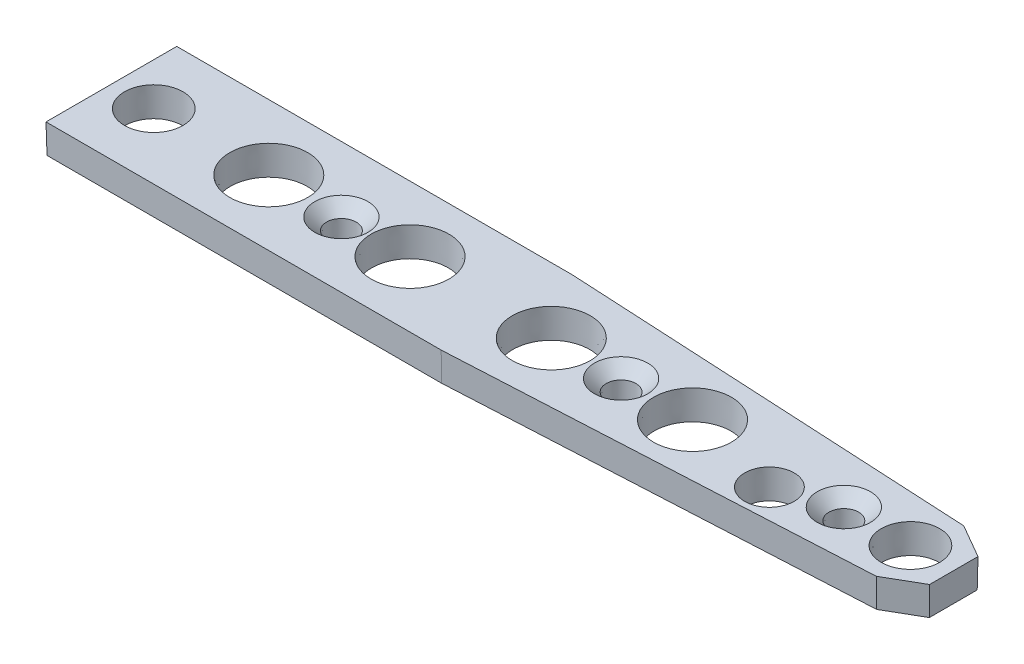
ISO-10303-21;
HEADER;
FILE_DESCRIPTION(('STEP AP214'),'2;1');
FILE_NAME('part.step','',(''),(''),'','','');
FILE_SCHEMA(('AUTOMOTIVE_DESIGN { 1 0 10303 214 1 1 1 1 }'));
ENDSEC;
DATA;
#1=APPLICATION_CONTEXT('core data for automotive mechanical design processes');
#2=APPLICATION_PROTOCOL_DEFINITION('international standard','automotive_design',2000,#1);
#3=PRODUCT_CONTEXT('',#1,'mechanical');
#4=PRODUCT('Part','Part','',(#3));
#5=PRODUCT_RELATED_PRODUCT_CATEGORY('part','',(#4));
#6=PRODUCT_DEFINITION_FORMATION('','',#4);
#7=PRODUCT_DEFINITION_CONTEXT('part definition',#1,'design');
#8=PRODUCT_DEFINITION('design','',#6,#7);
#9=PRODUCT_DEFINITION_SHAPE('','',#8);
#10=(LENGTH_UNIT() NAMED_UNIT(*) SI_UNIT(.MILLI.,.METRE.));
#11=(NAMED_UNIT(*) PLANE_ANGLE_UNIT() SI_UNIT($,.RADIAN.));
#12=(NAMED_UNIT(*) SI_UNIT($,.STERADIAN.) SOLID_ANGLE_UNIT());
#13=UNCERTAINTY_MEASURE_WITH_UNIT(LENGTH_MEASURE(1.E-05),#10,'distance_accuracy_value','');
#14=(GEOMETRIC_REPRESENTATION_CONTEXT(3) GLOBAL_UNCERTAINTY_ASSIGNED_CONTEXT((#13)) GLOBAL_UNIT_ASSIGNED_CONTEXT((#10,
#11,#12)) REPRESENTATION_CONTEXT('',''));
#15=CARTESIAN_POINT('',(0.,0.,0.));
#16=DIRECTION('',(0.,0.,1.));
#17=DIRECTION('',(1.,0.,0.));
#18=AXIS2_PLACEMENT_3D('',#15,#16,#17);
#19=CARTESIAN_POINT('',(66.7909755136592,0.,3.61024403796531));
#20=DIRECTION('',(0.0523279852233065,-0.0174524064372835,0.99847743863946));
#21=DIRECTION('',(0.998629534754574,0.,-0.0523359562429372));
#22=AXIS2_PLACEMENT_3D('',#19,#20,#21);
#23=PLANE('',#22);
#24=DIRECTION('',(-0.998629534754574,0.,0.0523359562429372));
#25=VECTOR('',#24,1.);
#26=CARTESIAN_POINT('',(66.7887830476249,-2.4,3.56840929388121));
#27=LINE('',#26,#25);
#28=CARTESIAN_POINT('',(66.7787394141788,-2.4,3.56893565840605));
#29=VERTEX_POINT('',#28);
#30=CARTESIAN_POINT('',(32.6393003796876,-2.4,5.35810784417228));
#31=VERTEX_POINT('',#30);
#32=EDGE_CURVE('E44',#29,#31,#27,.T.);
#33=ORIENTED_EDGE('',*,*,#32,.F.);
#34=DIRECTION('',(0.00509755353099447,0.999838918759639,0.0172090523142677));
#35=VECTOR('',#34,1.);
#36=CARTESIAN_POINT('',(66.7909755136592,0.,3.61024403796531));
#37=LINE('',#36,#35);
#38=CARTESIAN_POINT('',(66.7909755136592,0.,3.61024403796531));
#39=VERTEX_POINT('',#38);
#40=EDGE_CURVE('E101',#29,#39,#37,.T.);
#41=ORIENTED_EDGE('',*,*,#40,.T.);
#42=DIRECTION('',(0.998629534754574,0.,-0.0523359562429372));
#43=VECTOR('',#42,1.);
#44=CARTESIAN_POINT('',(66.7909755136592,0.,3.61024403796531));
#45=LINE('',#44,#43);
#46=CARTESIAN_POINT('',(32.6403973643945,0.,5.4));
#47=VERTEX_POINT('',#46);
#48=EDGE_CURVE('E105',#47,#39,#45,.T.);
#49=ORIENTED_EDGE('',*,*,#48,.F.);
#50=DIRECTION('',(0.000457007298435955,0.999847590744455,0.0174524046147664));
#51=VECTOR('',#50,1.);
#52=CARTESIAN_POINT('',(32.6403973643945,0.,5.4));
#53=LINE('',#52,#51);
#54=EDGE_CURVE('E187',#31,#47,#53,.T.);
#55=ORIENTED_EDGE('',*,*,#54,.F.);
#56=EDGE_LOOP('',(#33,#41,#49,#55));
#57=FACE_BOUND('',#56,.T.);
#58=ADVANCED_FACE('F34',(#57),#23,.T.);
#59=CARTESIAN_POINT('',(32.6403973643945,0.,5.4));
#60=DIRECTION('',(0.,-0.0174524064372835,0.999847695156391));
#61=DIRECTION('',(0.,-0.999847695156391,-0.0174524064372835));
#62=AXIS2_PLACEMENT_3D('',#59,#60,#61);
#63=PLANE('',#62);
#64=DIRECTION('',(-1.,0.,0.));
#65=VECTOR('',#64,1.);
#66=CARTESIAN_POINT('',(32.6403973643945,-2.4,5.35810784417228));
#67=LINE('',#66,#65);
#68=CARTESIAN_POINT('',(0.0418921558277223,-2.4,5.35810784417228));
#69=VERTEX_POINT('',#68);
#70=EDGE_CURVE('E38',#31,#69,#67,.T.);
#71=ORIENTED_EDGE('',*,*,#70,.F.);
#72=ORIENTED_EDGE('',*,*,#54,.T.);
#73=DIRECTION('',(1.,0.,0.));
#74=VECTOR('',#73,1.);
#75=CARTESIAN_POINT('',(32.6403973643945,0.,5.4));
#76=LINE('',#75,#74);
#77=CARTESIAN_POINT('',(0.,0.,5.4));
#78=VERTEX_POINT('',#77);
#79=EDGE_CURVE('E110',#78,#47,#76,.T.);
#80=ORIENTED_EDGE('',*,*,#79,.F.);
#81=DIRECTION('',(-0.0174497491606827,0.999695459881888,0.0174497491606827));
#82=VECTOR('',#81,1.);
#83=CARTESIAN_POINT('',(0.00328853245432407,-0.188399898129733,5.39671146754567));
#84=LINE('',#83,#82);
#85=EDGE_CURVE('E185',#69,#78,#84,.T.);
#86=ORIENTED_EDGE('',*,*,#85,.F.);
#87=EDGE_LOOP('',(#71,#72,#80,#86));
#88=FACE_BOUND('',#87,.T.);
#89=ADVANCED_FACE('F36',(#88),#63,.T.);
#90=CARTESIAN_POINT('',(0.,0.,-5.4));
#91=DIRECTION('',(-0.999847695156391,-0.0174524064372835,0.));
#92=DIRECTION('',(0.0174524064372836,-0.999847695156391,0.));
#93=AXIS2_PLACEMENT_3D('',#90,#91,#92);
#94=PLANE('',#93);
#95=DIRECTION('',(0.,0.,-1.));
#96=VECTOR('',#95,1.);
#97=CARTESIAN_POINT('',(0.0418921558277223,-2.4,-5.4));
#98=LINE('',#97,#96);
#99=CARTESIAN_POINT('',(0.0418921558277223,-2.4,-5.35810784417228));
#100=VERTEX_POINT('',#99);
#101=EDGE_CURVE('E73',#69,#100,#98,.T.);
#102=ORIENTED_EDGE('',*,*,#101,.F.);
#103=ORIENTED_EDGE('',*,*,#85,.T.);
#104=DIRECTION('',(0.,0.,1.));
#105=VECTOR('',#104,1.);
#106=CARTESIAN_POINT('',(0.,0.,-5.4));
#107=LINE('',#106,#105);
#108=CARTESIAN_POINT('',(0.,0.,-5.4));
#109=VERTEX_POINT('',#108);
#110=EDGE_CURVE('E142',#109,#78,#107,.T.);
#111=ORIENTED_EDGE('',*,*,#110,.F.);
#112=DIRECTION('',(-0.0174497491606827,0.999695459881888,-0.0174497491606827));
#113=VECTOR('',#112,1.);
#114=CARTESIAN_POINT('',(0.,0.,-5.4));
#115=LINE('',#114,#113);
#116=EDGE_CURVE('E188',#100,#109,#115,.T.);
#117=ORIENTED_EDGE('',*,*,#116,.F.);
#118=EDGE_LOOP('',(#102,#103,#111,#117));
#119=FACE_BOUND('',#118,.T.);
#120=ADVANCED_FACE('F226',(#119),#94,.T.);
#121=CARTESIAN_POINT('',(0.,0.,-5.4));
#122=DIRECTION('',(0.,-0.0174524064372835,-0.999847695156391));
#123=DIRECTION('',(0.,0.999847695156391,-0.0174524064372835));
#124=AXIS2_PLACEMENT_3D('',#121,#122,#123);
#125=PLANE('',#124);
#126=DIRECTION('',(1.,0.,0.));
#127=VECTOR('',#126,1.);
#128=CARTESIAN_POINT('',(0.,-2.4,-5.35810784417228));
#129=LINE('',#128,#127);
#130=CARTESIAN_POINT('',(32.6393003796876,-2.4,-5.35810784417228));
#131=VERTEX_POINT('',#130);
#132=EDGE_CURVE('E200',#100,#131,#129,.T.);
#133=ORIENTED_EDGE('',*,*,#132,.F.);
#134=ORIENTED_EDGE('',*,*,#116,.T.);
#135=DIRECTION('',(-1.,0.,0.));
#136=VECTOR('',#135,1.);
#137=CARTESIAN_POINT('',(0.,0.,-5.4));
#138=LINE('',#137,#136);
#139=CARTESIAN_POINT('',(32.6403973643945,0.,-5.4));
#140=VERTEX_POINT('',#139);
#141=EDGE_CURVE('E139',#140,#109,#138,.T.);
#142=ORIENTED_EDGE('',*,*,#141,.F.);
#143=DIRECTION('',(0.000457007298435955,0.999847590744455,-0.0174524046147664));
#144=VECTOR('',#143,1.);
#145=CARTESIAN_POINT('',(32.6403973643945,0.,-5.4));
#146=LINE('',#145,#144);
#147=EDGE_CURVE('E190',#131,#140,#146,.T.);
#148=ORIENTED_EDGE('',*,*,#147,.F.);
#149=EDGE_LOOP('',(#133,#134,#142,#148));
#150=FACE_BOUND('',#149,.T.);
#151=ADVANCED_FACE('F220',(#150),#125,.T.);
#152=CARTESIAN_POINT('',(32.6403973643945,0.,-5.4));
#153=DIRECTION('',(0.0523279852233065,-0.0174524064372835,-0.99847743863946));
#154=DIRECTION('',(-0.998629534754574,0.,-0.0523359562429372));
#155=AXIS2_PLACEMENT_3D('',#152,#153,#154);
#156=PLANE('',#155);
#157=DIRECTION('',(0.998629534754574,0.,0.0523359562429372));
#158=VECTOR('',#157,1.);
#159=CARTESIAN_POINT('',(32.6382048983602,-2.4,-5.3581652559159));
#160=LINE('',#159,#158);
#161=CARTESIAN_POINT('',(66.7787394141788,-2.4,-3.56893565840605));
#162=VERTEX_POINT('',#161);
#163=EDGE_CURVE('E202',#131,#162,#160,.T.);
#164=ORIENTED_EDGE('',*,*,#163,.F.);
#165=ORIENTED_EDGE('',*,*,#147,.T.);
#166=DIRECTION('',(-0.998629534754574,0.,-0.0523359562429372));
#167=VECTOR('',#166,1.);
#168=CARTESIAN_POINT('',(32.6403973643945,0.,-5.4));
#169=LINE('',#168,#167);
#170=CARTESIAN_POINT('',(66.7909755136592,0.,-3.61024403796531));
#171=VERTEX_POINT('',#170);
#172=EDGE_CURVE('E136',#171,#140,#169,.T.);
#173=ORIENTED_EDGE('',*,*,#172,.F.);
#174=DIRECTION('',(0.00509755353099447,0.999838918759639,-0.0172090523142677));
#175=VECTOR('',#174,1.);
#176=CARTESIAN_POINT('',(66.7909067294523,-0.0134913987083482,-3.61001182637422));
#177=LINE('',#176,#175);
#178=EDGE_CURVE('E192',#162,#171,#177,.T.);
#179=ORIENTED_EDGE('',*,*,#178,.F.);
#180=EDGE_LOOP('',(#164,#165,#173,#179));
#181=FACE_BOUND('',#180,.T.);
#182=ADVANCED_FACE('F216',(#181),#156,.T.);
#183=CARTESIAN_POINT('',(69.58,0.,-2.));
#184=DIRECTION('',(0.4999238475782,-0.0174524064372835,-0.865893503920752));
#185=DIRECTION('',(-0.866025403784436,0.,-0.500000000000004));
#186=AXIS2_PLACEMENT_3D('',#183,#184,#185);
#187=PLANE('',#186);
#188=DIRECTION('',(0.866025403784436,0.,0.500000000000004));
#189=VECTOR('',#188,1.);
#190=CARTESIAN_POINT('',(69.5590539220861,-2.4,-1.9637203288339));
#191=LINE('',#190,#189);
#192=CARTESIAN_POINT('',(69.5381078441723,-2.4,-1.97581355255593));
#193=VERTEX_POINT('',#192);
#194=EDGE_CURVE('E53',#162,#193,#191,.T.);
#195=ORIENTED_EDGE('',*,*,#194,.F.);
#196=ORIENTED_EDGE('',*,*,#178,.T.);
#197=DIRECTION('',(-0.866025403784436,0.,-0.500000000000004));
#198=VECTOR('',#197,1.);
#199=CARTESIAN_POINT('',(69.58,0.,-2.));
#200=LINE('',#199,#198);
#201=CARTESIAN_POINT('',(69.58,0.,-2.));
#202=VERTEX_POINT('',#201);
#203=EDGE_CURVE('E133',#202,#171,#200,.T.);
#204=ORIENTED_EDGE('',*,*,#203,.F.);
#205=DIRECTION('',(0.0174515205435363,0.999796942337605,-0.0100756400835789));
#206=VECTOR('',#205,1.);
#207=CARTESIAN_POINT('',(69.58,0.,-2.));
#208=LINE('',#207,#206);
#209=EDGE_CURVE('E194',#193,#202,#208,.T.);
#210=ORIENTED_EDGE('',*,*,#209,.F.);
#211=EDGE_LOOP('',(#195,#196,#204,#210));
#212=FACE_BOUND('',#211,.T.);
#213=ADVANCED_FACE('F212',(#212),#187,.T.);
#214=CARTESIAN_POINT('',(69.58,0.,-2.));
#215=DIRECTION('',(0.999847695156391,-0.0174524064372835,0.));
#216=DIRECTION('',(0.0174524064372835,0.999847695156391,0.));
#217=AXIS2_PLACEMENT_3D('',#214,#215,#216);
#218=PLANE('',#217);
#219=DIRECTION('',(0.,0.,1.));
#220=VECTOR('',#219,1.);
#221=CARTESIAN_POINT('',(69.5381078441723,-2.4,-2.));
#222=LINE('',#221,#220);
#223=CARTESIAN_POINT('',(69.5381078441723,-2.4,1.97581355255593));
#224=VERTEX_POINT('',#223);
#225=EDGE_CURVE('E198',#193,#224,#222,.T.);
#226=ORIENTED_EDGE('',*,*,#225,.F.);
#227=ORIENTED_EDGE('',*,*,#209,.T.);
#228=DIRECTION('',(0.,0.,-1.));
#229=VECTOR('',#228,1.);
#230=CARTESIAN_POINT('',(69.58,0.,-2.));
#231=LINE('',#230,#229);
#232=CARTESIAN_POINT('',(69.58,0.,2.));
#233=VERTEX_POINT('',#232);
#234=EDGE_CURVE('E119',#233,#202,#231,.T.);
#235=ORIENTED_EDGE('',*,*,#234,.F.);
#236=DIRECTION('',(0.0174515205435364,0.999796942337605,0.0100756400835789));
#237=VECTOR('',#236,1.);
#238=CARTESIAN_POINT('',(69.58,0.,2.));
#239=LINE('',#238,#237);
#240=EDGE_CURVE('E109',#224,#233,#239,.T.);
#241=ORIENTED_EDGE('',*,*,#240,.F.);
#242=EDGE_LOOP('',(#226,#227,#235,#241));
#243=FACE_BOUND('',#242,.T.);
#244=ADVANCED_FACE('F208',(#243),#218,.T.);
#245=CARTESIAN_POINT('',(69.58,0.,2.));
#246=DIRECTION('',(0.499923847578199,-0.0174524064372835,0.865893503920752));
#247=DIRECTION('',(0.866025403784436,0.,-0.500000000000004));
#248=AXIS2_PLACEMENT_3D('',#245,#246,#247);
#249=PLANE('',#248);
#250=DIRECTION('',(-0.866025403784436,0.,0.500000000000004));
#251=VECTOR('',#250,1.);
#252=CARTESIAN_POINT('',(69.5590539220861,-2.4,1.9637203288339));
#253=LINE('',#252,#251);
#254=EDGE_CURVE('E11',#224,#29,#253,.T.);
#255=ORIENTED_EDGE('',*,*,#254,.F.);
#256=ORIENTED_EDGE('',*,*,#240,.T.);
#257=DIRECTION('',(0.866025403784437,0.,-0.500000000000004));
#258=VECTOR('',#257,1.);
#259=CARTESIAN_POINT('',(69.58,0.,2.));
#260=LINE('',#259,#258);
#261=EDGE_CURVE('E113',#39,#233,#260,.T.);
#262=ORIENTED_EDGE('',*,*,#261,.F.);
#263=ORIENTED_EDGE('',*,*,#40,.F.);
#264=EDGE_LOOP('',(#255,#256,#262,#263));
#265=FACE_BOUND('',#264,.T.);
#266=ADVANCED_FACE('F114',(#265),#249,.T.);
#267=CARTESIAN_POINT('',(0.,0.,0.));
#268=DIRECTION('',(0.,1.,0.));
#269=DIRECTION('',(0.,0.,1.));
#270=AXIS2_PLACEMENT_3D('',#267,#268,#269);
#271=PLANE('',#270);
#272=CARTESIAN_POINT('',(56.,0.,1.65));
#273=DIRECTION('',(0.,1.,0.));
#274=DIRECTION('',(0.,0.,1.));
#275=AXIS2_PLACEMENT_3D('',#272,#273,#274);
#276=CIRCLE('',#275,2.04189215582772);
#277=CARTESIAN_POINT('',(56.,0.,3.69189215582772));
#278=VERTEX_POINT('',#277);
#279=EDGE_CURVE('E178',#278,#278,#276,.T.);
#280=ORIENTED_EDGE('',*,*,#279,.F.);
#281=EDGE_LOOP('',(#280));
#282=FACE_BOUND('',#281,.T.);
#283=CARTESIAN_POINT('',(13.,0.,0.));
#284=DIRECTION('',(0.,1.,0.));
#285=DIRECTION('',(0.,0.,1.));
#286=AXIS2_PLACEMENT_3D('',#283,#284,#285);
#287=CIRCLE('',#286,3.21689215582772);
#288=CARTESIAN_POINT('',(13.,0.,3.21689215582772));
#289=VERTEX_POINT('',#288);
#290=EDGE_CURVE('E151',#289,#289,#287,.T.);
#291=ORIENTED_EDGE('',*,*,#290,.F.);
#292=EDGE_LOOP('',(#291));
#293=FACE_BOUND('',#292,.T.);
#294=CARTESIAN_POINT('',(24.6666666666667,0.,0.));
#295=DIRECTION('',(0.,1.,0.));
#296=DIRECTION('',(0.,0.,1.));
#297=AXIS2_PLACEMENT_3D('',#294,#295,#296);
#298=CIRCLE('',#297,3.21689215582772);
#299=CARTESIAN_POINT('',(24.6666666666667,0.,3.21689215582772));
#300=VERTEX_POINT('',#299);
#301=EDGE_CURVE('E161',#300,#300,#298,.T.);
#302=ORIENTED_EDGE('',*,*,#301,.F.);
#303=EDGE_LOOP('',(#302));
#304=FACE_BOUND('',#303,.T.);
#305=CARTESIAN_POINT('',(36.3333333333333,0.,0.));
#306=DIRECTION('',(0.,1.,0.));
#307=DIRECTION('',(0.,0.,1.));
#308=AXIS2_PLACEMENT_3D('',#305,#306,#307);
#309=CIRCLE('',#308,3.21689215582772);
#310=CARTESIAN_POINT('',(36.3333333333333,0.,3.21689215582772));
#311=VERTEX_POINT('',#310);
#312=EDGE_CURVE('E165',#311,#311,#309,.T.);
#313=ORIENTED_EDGE('',*,*,#312,.F.);
#314=EDGE_LOOP('',(#313));
#315=FACE_BOUND('',#314,.T.);
#316=CARTESIAN_POINT('',(48.,0.,0.));
#317=DIRECTION('',(0.,1.,0.));
#318=DIRECTION('',(0.,0.,1.));
#319=AXIS2_PLACEMENT_3D('',#316,#317,#318);
#320=CIRCLE('',#319,3.21689215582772);
#321=CARTESIAN_POINT('',(48.,0.,3.21689215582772));
#322=VERTEX_POINT('',#321);
#323=EDGE_CURVE('E174',#322,#322,#320,.T.);
#324=ORIENTED_EDGE('',*,*,#323,.F.);
#325=EDGE_LOOP('',(#324));
#326=FACE_BOUND('',#325,.T.);
#327=CARTESIAN_POINT('',(19.,0.,0.));
#328=DIRECTION('',(0.,1.,0.));
#329=DIRECTION('',(0.,0.,1.));
#330=AXIS2_PLACEMENT_3D('',#327,#328,#329);
#331=CIRCLE('',#330,2.2);
#332=CARTESIAN_POINT('',(19.,0.,2.2));
#333=VERTEX_POINT('',#332);
#334=EDGE_CURVE('E160',#333,#333,#331,.T.);
#335=ORIENTED_EDGE('',*,*,#334,.F.);
#336=EDGE_LOOP('',(#335));
#337=FACE_BOUND('',#336,.T.);
#338=CARTESIAN_POINT('',(42.1,0.,0.));
#339=DIRECTION('',(0.,1.,0.));
#340=DIRECTION('',(0.,0.,1.));
#341=AXIS2_PLACEMENT_3D('',#338,#339,#340);
#342=CIRCLE('',#341,2.2);
#343=CARTESIAN_POINT('',(42.1,0.,2.2));
#344=VERTEX_POINT('',#343);
#345=EDGE_CURVE('E173',#344,#344,#342,.T.);
#346=ORIENTED_EDGE('',*,*,#345,.F.);
#347=EDGE_LOOP('',(#346));
#348=FACE_BOUND('',#347,.T.);
#349=CARTESIAN_POINT('',(60.5,0.,0.));
#350=DIRECTION('',(0.,1.,0.));
#351=DIRECTION('',(0.,0.,1.));
#352=AXIS2_PLACEMENT_3D('',#349,#350,#351);
#353=CIRCLE('',#352,2.2);
#354=CARTESIAN_POINT('',(60.5,0.,2.2));
#355=VERTEX_POINT('',#354);
#356=EDGE_CURVE('E184',#355,#355,#353,.T.);
#357=ORIENTED_EDGE('',*,*,#356,.F.);
#358=EDGE_LOOP('',(#357));
#359=FACE_BOUND('',#358,.T.);
#360=CARTESIAN_POINT('',(3.5,0.,0.));
#361=DIRECTION('',(0.,1.,0.));
#362=DIRECTION('',(0.,0.,1.));
#363=AXIS2_PLACEMENT_3D('',#360,#361,#362);
#364=CIRCLE('',#363,2.41689215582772);
#365=CARTESIAN_POINT('',(3.5,0.,2.41689215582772));
#366=VERTEX_POINT('',#365);
#367=EDGE_CURVE('E127',#366,#366,#364,.T.);
#368=ORIENTED_EDGE('',*,*,#367,.F.);
#369=EDGE_LOOP('',(#368));
#370=FACE_BOUND('',#369,.T.);
#371=CARTESIAN_POINT('',(66.,0.,0.));
#372=DIRECTION('',(0.,1.,0.));
#373=DIRECTION('',(0.,0.,1.));
#374=AXIS2_PLACEMENT_3D('',#371,#372,#373);
#375=CIRCLE('',#374,2.41689215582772);
#376=CARTESIAN_POINT('',(66.,0.,2.41689215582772));
#377=VERTEX_POINT('',#376);
#378=EDGE_CURVE('E145',#377,#377,#375,.T.);
#379=ORIENTED_EDGE('',*,*,#378,.F.);
#380=EDGE_LOOP('',(#379));
#381=FACE_BOUND('',#380,.T.);
#382=ORIENTED_EDGE('',*,*,#48,.T.);
#383=ORIENTED_EDGE('',*,*,#261,.T.);
#384=ORIENTED_EDGE('',*,*,#234,.T.);
#385=ORIENTED_EDGE('',*,*,#203,.T.);
#386=ORIENTED_EDGE('',*,*,#172,.T.);
#387=ORIENTED_EDGE('',*,*,#141,.T.);
#388=ORIENTED_EDGE('',*,*,#110,.T.);
#389=ORIENTED_EDGE('',*,*,#79,.T.);
#390=EDGE_LOOP('',(#382,#383,#384,#385,#386,#387,#388,#389));
#391=FACE_BOUND('',#390,.T.);
#392=ADVANCED_FACE('F121',(#282,#293,#304,#315,#326,#337,#348,#359,#370,#381,#391),#271,.T.);
#393=CARTESIAN_POINT('',(0.,-2.4,0.));
#394=DIRECTION('',(0.,1.,0.));
#395=DIRECTION('',(0.,0.,1.));
#396=AXIS2_PLACEMENT_3D('',#393,#394,#395);
#397=PLANE('',#396);
#398=CARTESIAN_POINT('',(56.,-2.4,1.65));
#399=DIRECTION('',(0.,1.,0.));
#400=DIRECTION('',(0.,0.,1.));
#401=AXIS2_PLACEMENT_3D('',#398,#399,#400);
#402=CIRCLE('',#401,2.);
#403=CARTESIAN_POINT('',(56.,-2.4,3.65));
#404=VERTEX_POINT('',#403);
#405=EDGE_CURVE('E177',#404,#404,#402,.T.);
#406=ORIENTED_EDGE('',*,*,#405,.T.);
#407=EDGE_LOOP('',(#406));
#408=FACE_BOUND('',#407,.T.);
#409=CARTESIAN_POINT('',(13.,-2.4,0.));
#410=DIRECTION('',(0.,1.,0.));
#411=DIRECTION('',(0.,0.,1.));
#412=AXIS2_PLACEMENT_3D('',#409,#410,#411);
#413=CIRCLE('',#412,3.175);
#414=CARTESIAN_POINT('',(13.,-2.4,3.175));
#415=VERTEX_POINT('',#414);
#416=EDGE_CURVE('E154',#415,#415,#413,.T.);
#417=ORIENTED_EDGE('',*,*,#416,.T.);
#418=EDGE_LOOP('',(#417));
#419=FACE_BOUND('',#418,.T.);
#420=CARTESIAN_POINT('',(24.6666666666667,-2.4,0.));
#421=DIRECTION('',(0.,1.,0.));
#422=DIRECTION('',(0.,0.,1.));
#423=AXIS2_PLACEMENT_3D('',#420,#421,#422);
#424=CIRCLE('',#423,3.175);
#425=CARTESIAN_POINT('',(24.6666666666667,-2.4,3.175));
#426=VERTEX_POINT('',#425);
#427=EDGE_CURVE('E155',#426,#426,#424,.T.);
#428=ORIENTED_EDGE('',*,*,#427,.T.);
#429=EDGE_LOOP('',(#428));
#430=FACE_BOUND('',#429,.T.);
#431=CARTESIAN_POINT('',(36.3333333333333,-2.4,0.));
#432=DIRECTION('',(0.,1.,0.));
#433=DIRECTION('',(0.,0.,1.));
#434=AXIS2_PLACEMENT_3D('',#431,#432,#433);
#435=CIRCLE('',#434,3.175);
#436=CARTESIAN_POINT('',(36.3333333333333,-2.4,3.175));
#437=VERTEX_POINT('',#436);
#438=EDGE_CURVE('E164',#437,#437,#435,.T.);
#439=ORIENTED_EDGE('',*,*,#438,.T.);
#440=EDGE_LOOP('',(#439));
#441=FACE_BOUND('',#440,.T.);
#442=CARTESIAN_POINT('',(48.,-2.4,0.));
#443=DIRECTION('',(0.,1.,0.));
#444=DIRECTION('',(0.,0.,1.));
#445=AXIS2_PLACEMENT_3D('',#442,#443,#444);
#446=CIRCLE('',#445,3.175);
#447=CARTESIAN_POINT('',(48.,-2.4,3.175));
#448=VERTEX_POINT('',#447);
#449=EDGE_CURVE('E168',#448,#448,#446,.T.);
#450=ORIENTED_EDGE('',*,*,#449,.T.);
#451=EDGE_LOOP('',(#450));
#452=FACE_BOUND('',#451,.T.);
#453=CARTESIAN_POINT('',(19.,-2.4,0.));
#454=DIRECTION('',(0.,1.,0.));
#455=DIRECTION('',(0.,0.,1.));
#456=AXIS2_PLACEMENT_3D('',#453,#454,#455);
#457=CIRCLE('',#456,1.2);
#458=CARTESIAN_POINT('',(19.,-2.4,1.2));
#459=VERTEX_POINT('',#458);
#460=EDGE_CURVE('E159',#459,#459,#457,.T.);
#461=ORIENTED_EDGE('',*,*,#460,.T.);
#462=EDGE_LOOP('',(#461));
#463=FACE_BOUND('',#462,.T.);
#464=CARTESIAN_POINT('',(42.1,-2.4,0.));
#465=DIRECTION('',(0.,1.,0.));
#466=DIRECTION('',(0.,0.,1.));
#467=AXIS2_PLACEMENT_3D('',#464,#465,#466);
#468=CIRCLE('',#467,1.2);
#469=CARTESIAN_POINT('',(42.1,-2.4,1.2));
#470=VERTEX_POINT('',#469);
#471=EDGE_CURVE('E172',#470,#470,#468,.T.);
#472=ORIENTED_EDGE('',*,*,#471,.T.);
#473=EDGE_LOOP('',(#472));
#474=FACE_BOUND('',#473,.T.);
#475=CARTESIAN_POINT('',(60.5,-2.4,0.));
#476=DIRECTION('',(0.,1.,0.));
#477=DIRECTION('',(0.,0.,1.));
#478=AXIS2_PLACEMENT_3D('',#475,#476,#477);
#479=CIRCLE('',#478,1.2);
#480=CARTESIAN_POINT('',(60.5,-2.4,1.2));
#481=VERTEX_POINT('',#480);
#482=EDGE_CURVE('E148',#481,#481,#479,.T.);
#483=ORIENTED_EDGE('',*,*,#482,.T.);
#484=EDGE_LOOP('',(#483));
#485=FACE_BOUND('',#484,.T.);
#486=CARTESIAN_POINT('',(3.5,-2.4,0.));
#487=DIRECTION('',(0.,1.,0.));
#488=DIRECTION('',(0.,0.,1.));
#489=AXIS2_PLACEMENT_3D('',#486,#487,#488);
#490=CIRCLE('',#489,2.375);
#491=CARTESIAN_POINT('',(3.5,-2.4,2.375));
#492=VERTEX_POINT('',#491);
#493=EDGE_CURVE('E124',#492,#492,#490,.T.);
#494=ORIENTED_EDGE('',*,*,#493,.T.);
#495=EDGE_LOOP('',(#494));
#496=FACE_BOUND('',#495,.T.);
#497=CARTESIAN_POINT('',(66.,-2.4,0.));
#498=DIRECTION('',(0.,1.,0.));
#499=DIRECTION('',(0.,0.,1.));
#500=AXIS2_PLACEMENT_3D('',#497,#498,#499);
#501=CIRCLE('',#500,2.375);
#502=CARTESIAN_POINT('',(66.,-2.4,2.375));
#503=VERTEX_POINT('',#502);
#504=EDGE_CURVE('E130',#503,#503,#501,.T.);
#505=ORIENTED_EDGE('',*,*,#504,.T.);
#506=EDGE_LOOP('',(#505));
#507=FACE_BOUND('',#506,.T.);
#508=ORIENTED_EDGE('',*,*,#32,.T.);
#509=ORIENTED_EDGE('',*,*,#70,.T.);
#510=ORIENTED_EDGE('',*,*,#101,.T.);
#511=ORIENTED_EDGE('',*,*,#132,.T.);
#512=ORIENTED_EDGE('',*,*,#163,.T.);
#513=ORIENTED_EDGE('',*,*,#194,.T.);
#514=ORIENTED_EDGE('',*,*,#225,.T.);
#515=ORIENTED_EDGE('',*,*,#254,.T.);
#516=EDGE_LOOP('',(#508,#509,#510,#511,#512,#513,#514,#515));
#517=FACE_BOUND('',#516,.T.);
#518=ADVANCED_FACE('F205',(#408,#419,#430,#441,#452,#463,#474,#485,#496,#507,#517),#397,.F.);
#519=CARTESIAN_POINT('',(66.,-2.4,0.));
#520=DIRECTION('',(0.,1.,0.));
#521=DIRECTION('',(0.,0.,1.));
#522=AXIS2_PLACEMENT_3D('',#519,#520,#521);
#523=CONICAL_SURFACE('',#522,2.375,0.0174532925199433);
#524=ORIENTED_EDGE('',*,*,#504,.F.);
#525=EDGE_LOOP('',(#524));
#526=FACE_BOUND('',#525,.T.);
#527=ORIENTED_EDGE('',*,*,#378,.T.);
#528=EDGE_LOOP('',(#527));
#529=FACE_BOUND('',#528,.T.);
#530=ADVANCED_FACE('F276',(#526,#529),#523,.F.);
#531=CARTESIAN_POINT('',(3.5,-2.4,0.));
#532=DIRECTION('',(0.,1.,0.));
#533=DIRECTION('',(0.,0.,1.));
#534=AXIS2_PLACEMENT_3D('',#531,#532,#533);
#535=CONICAL_SURFACE('',#534,2.375,0.0174532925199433);
#536=ORIENTED_EDGE('',*,*,#493,.F.);
#537=EDGE_LOOP('',(#536));
#538=FACE_BOUND('',#537,.T.);
#539=ORIENTED_EDGE('',*,*,#367,.T.);
#540=EDGE_LOOP('',(#539));
#541=FACE_BOUND('',#540,.T.);
#542=ADVANCED_FACE('F283',(#538,#541),#535,.F.);
#543=CARTESIAN_POINT('',(60.5,-2.4,0.));
#544=DIRECTION('',(0.,1.,0.));
#545=DIRECTION('',(0.,0.,1.));
#546=AXIS2_PLACEMENT_3D('',#543,#544,#545);
#547=CONICAL_SURFACE('',#546,1.2,0.0174532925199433);
#548=ORIENTED_EDGE('',*,*,#482,.F.);
#549=EDGE_LOOP('',(#548));
#550=FACE_BOUND('',#549,.T.);
#551=CARTESIAN_POINT('',(60.5,-0.975128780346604,0.));
#552=DIRECTION('',(0.,1.,0.));
#553=DIRECTION('',(0.,0.,1.));
#554=AXIS2_PLACEMENT_3D('',#551,#552,#553);
#555=CIRCLE('',#554,1.2248712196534);
#556=CARTESIAN_POINT('',(60.5,-0.975128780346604,1.2248712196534));
#557=VERTEX_POINT('',#556);
#558=EDGE_CURVE('E181',#557,#557,#555,.T.);
#559=ORIENTED_EDGE('',*,*,#558,.T.);
#560=EDGE_LOOP('',(#559));
#561=FACE_BOUND('',#560,.T.);
#562=ADVANCED_FACE('F291',(#550,#561),#547,.F.);
#563=CARTESIAN_POINT('',(60.5,0.,0.));
#564=DIRECTION('',(0.,1.,0.));
#565=DIRECTION('',(0.,0.,1.));
#566=AXIS2_PLACEMENT_3D('',#563,#564,#565);
#567=CONICAL_SURFACE('',#566,2.2,0.785398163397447);
#568=ORIENTED_EDGE('',*,*,#558,.F.);
#569=EDGE_LOOP('',(#568));
#570=FACE_BOUND('',#569,.T.);
#571=ORIENTED_EDGE('',*,*,#356,.T.);
#572=EDGE_LOOP('',(#571));
#573=FACE_BOUND('',#572,.T.);
#574=ADVANCED_FACE('F298',(#570,#573),#567,.F.);
#575=CARTESIAN_POINT('',(42.1,-2.4,0.));
#576=DIRECTION('',(0.,1.,0.));
#577=DIRECTION('',(0.,0.,1.));
#578=AXIS2_PLACEMENT_3D('',#575,#576,#577);
#579=CONICAL_SURFACE('',#578,1.2,0.0174532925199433);
#580=ORIENTED_EDGE('',*,*,#471,.F.);
#581=EDGE_LOOP('',(#580));
#582=FACE_BOUND('',#581,.T.);
#583=CARTESIAN_POINT('',(42.1,-0.975128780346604,0.));
#584=DIRECTION('',(0.,1.,0.));
#585=DIRECTION('',(0.,0.,1.));
#586=AXIS2_PLACEMENT_3D('',#583,#584,#585);
#587=CIRCLE('',#586,1.2248712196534);
#588=CARTESIAN_POINT('',(42.1,-0.975128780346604,1.2248712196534));
#589=VERTEX_POINT('',#588);
#590=EDGE_CURVE('E169',#589,#589,#587,.T.);
#591=ORIENTED_EDGE('',*,*,#590,.T.);
#592=EDGE_LOOP('',(#591));
#593=FACE_BOUND('',#592,.T.);
#594=ADVANCED_FACE('F306',(#582,#593),#579,.F.);
#595=CARTESIAN_POINT('',(42.1,0.,0.));
#596=DIRECTION('',(0.,1.,0.));
#597=DIRECTION('',(0.,0.,1.));
#598=AXIS2_PLACEMENT_3D('',#595,#596,#597);
#599=CONICAL_SURFACE('',#598,2.2,0.785398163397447);
#600=ORIENTED_EDGE('',*,*,#590,.F.);
#601=EDGE_LOOP('',(#600));
#602=FACE_BOUND('',#601,.T.);
#603=ORIENTED_EDGE('',*,*,#345,.T.);
#604=EDGE_LOOP('',(#603));
#605=FACE_BOUND('',#604,.T.);
#606=ADVANCED_FACE('F314',(#602,#605),#599,.F.);
#607=CARTESIAN_POINT('',(19.,-2.4,0.));
#608=DIRECTION('',(0.,1.,0.));
#609=DIRECTION('',(0.,0.,1.));
#610=AXIS2_PLACEMENT_3D('',#607,#608,#609);
#611=CONICAL_SURFACE('',#610,1.2,0.0174532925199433);
#612=ORIENTED_EDGE('',*,*,#460,.F.);
#613=EDGE_LOOP('',(#612));
#614=FACE_BOUND('',#613,.T.);
#615=CARTESIAN_POINT('',(19.,-0.975128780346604,0.));
#616=DIRECTION('',(0.,1.,0.));
#617=DIRECTION('',(0.,0.,1.));
#618=AXIS2_PLACEMENT_3D('',#615,#616,#617);
#619=CIRCLE('',#618,1.2248712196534);
#620=CARTESIAN_POINT('',(19.,-0.975128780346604,1.2248712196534));
#621=VERTEX_POINT('',#620);
#622=EDGE_CURVE('E156',#621,#621,#619,.T.);
#623=ORIENTED_EDGE('',*,*,#622,.T.);
#624=EDGE_LOOP('',(#623));
#625=FACE_BOUND('',#624,.T.);
#626=ADVANCED_FACE('F322',(#614,#625),#611,.F.);
#627=CARTESIAN_POINT('',(19.,0.,0.));
#628=DIRECTION('',(0.,1.,0.));
#629=DIRECTION('',(0.,0.,1.));
#630=AXIS2_PLACEMENT_3D('',#627,#628,#629);
#631=CONICAL_SURFACE('',#630,2.2,0.785398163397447);
#632=ORIENTED_EDGE('',*,*,#622,.F.);
#633=EDGE_LOOP('',(#632));
#634=FACE_BOUND('',#633,.T.);
#635=ORIENTED_EDGE('',*,*,#334,.T.);
#636=EDGE_LOOP('',(#635));
#637=FACE_BOUND('',#636,.T.);
#638=ADVANCED_FACE('F330',(#634,#637),#631,.F.);
#639=CARTESIAN_POINT('',(48.,-2.4,0.));
#640=DIRECTION('',(0.,1.,0.));
#641=DIRECTION('',(0.,0.,1.));
#642=AXIS2_PLACEMENT_3D('',#639,#640,#641);
#643=CONICAL_SURFACE('',#642,3.175,0.0174532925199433);
#644=ORIENTED_EDGE('',*,*,#449,.F.);
#645=EDGE_LOOP('',(#644));
#646=FACE_BOUND('',#645,.T.);
#647=ORIENTED_EDGE('',*,*,#323,.T.);
#648=EDGE_LOOP('',(#647));
#649=FACE_BOUND('',#648,.T.);
#650=ADVANCED_FACE('F338',(#646,#649),#643,.F.);
#651=CARTESIAN_POINT('',(36.3333333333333,-2.4,0.));
#652=DIRECTION('',(0.,1.,0.));
#653=DIRECTION('',(0.,0.,1.));
#654=AXIS2_PLACEMENT_3D('',#651,#652,#653);
#655=CONICAL_SURFACE('',#654,3.175,0.0174532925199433);
#656=ORIENTED_EDGE('',*,*,#438,.F.);
#657=EDGE_LOOP('',(#656));
#658=FACE_BOUND('',#657,.T.);
#659=ORIENTED_EDGE('',*,*,#312,.T.);
#660=EDGE_LOOP('',(#659));
#661=FACE_BOUND('',#660,.T.);
#662=ADVANCED_FACE('F346',(#658,#661),#655,.F.);
#663=CARTESIAN_POINT('',(24.6666666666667,-2.4,0.));
#664=DIRECTION('',(0.,1.,0.));
#665=DIRECTION('',(0.,0.,1.));
#666=AXIS2_PLACEMENT_3D('',#663,#664,#665);
#667=CONICAL_SURFACE('',#666,3.175,0.0174532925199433);
#668=ORIENTED_EDGE('',*,*,#427,.F.);
#669=EDGE_LOOP('',(#668));
#670=FACE_BOUND('',#669,.T.);
#671=ORIENTED_EDGE('',*,*,#301,.T.);
#672=EDGE_LOOP('',(#671));
#673=FACE_BOUND('',#672,.T.);
#674=ADVANCED_FACE('F354',(#670,#673),#667,.F.);
#675=CARTESIAN_POINT('',(13.,-2.4,0.));
#676=DIRECTION('',(0.,1.,0.));
#677=DIRECTION('',(0.,0.,1.));
#678=AXIS2_PLACEMENT_3D('',#675,#676,#677);
#679=CONICAL_SURFACE('',#678,3.175,0.0174532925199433);
#680=ORIENTED_EDGE('',*,*,#416,.F.);
#681=EDGE_LOOP('',(#680));
#682=FACE_BOUND('',#681,.T.);
#683=ORIENTED_EDGE('',*,*,#290,.T.);
#684=EDGE_LOOP('',(#683));
#685=FACE_BOUND('',#684,.T.);
#686=ADVANCED_FACE('F362',(#682,#685),#679,.F.);
#687=CARTESIAN_POINT('',(56.,-2.4,1.65));
#688=DIRECTION('',(0.,1.,0.));
#689=DIRECTION('',(0.,0.,1.));
#690=AXIS2_PLACEMENT_3D('',#687,#688,#689);
#691=CONICAL_SURFACE('',#690,2.,0.0174532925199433);
#692=ORIENTED_EDGE('',*,*,#405,.F.);
#693=EDGE_LOOP('',(#692));
#694=FACE_BOUND('',#693,.T.);
#695=ORIENTED_EDGE('',*,*,#279,.T.);
#696=EDGE_LOOP('',(#695));
#697=FACE_BOUND('',#696,.T.);
#698=ADVANCED_FACE('F370',(#694,#697),#691,.F.);
#699=CLOSED_SHELL('',(#58,#89,#120,#151,#182,#213,#244,#266,#392,#518,#530,#542,#562,#574,#594,
#606,#626,#638,#650,#662,#674,#686,#698));
#700=MANIFOLD_SOLID_BREP('B2',#699);
#701=ADVANCED_BREP_SHAPE_REPRESENTATION('',(#18,#700),#14);
#702=SHAPE_DEFINITION_REPRESENTATION(#9,#701);
ENDSEC;
END-ISO-10303-21;
